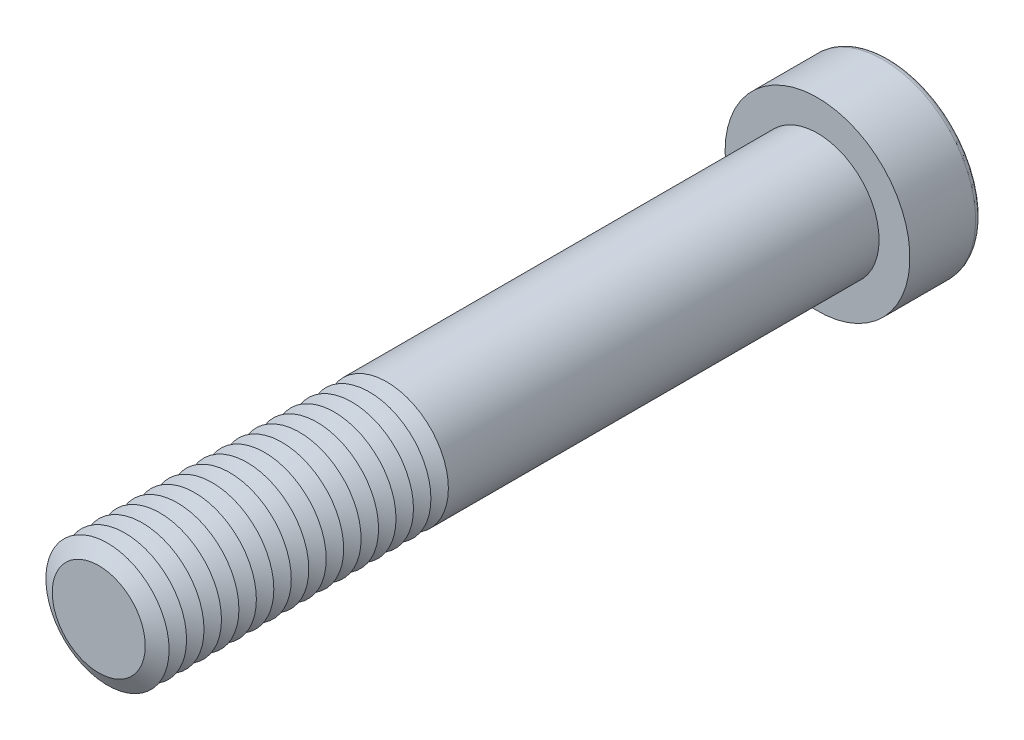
from build123d import *

# Parameters (mm, degrees)
SKETCH1_R           = 6
BOSS_EXTRUDE1_DEPTH = 70
SKETCH2_R           = 9
BOSS_EXTRUDE2_DEPTH = 7
CUT_EXTRUDE1_DEPTH  = 6
FILLET1_R           = 0.6
LPATTERN1_COUNT     = 17
LPATTERN1_PITCH     = 1.7


with BuildPart() as part:
    # Sketch1 → Boss-Extrude1 (new body)
    with BuildSketch(Plane.XY):
        Circle(SKETCH1_R)
    extrude(amount=BOSS_EXTRUDE1_DEPTH)

    # Sketch2 → Boss-Extrude2 (add)
    with BuildSketch(Plane(origin=(0, 0, 0), x_dir=(-1, 0, 0), z_dir=(0, 0, -1))):
        Circle(SKETCH2_R)
    extrude(amount=BOSS_EXTRUDE2_DEPTH)

    # Sketch3 → Cut-Extrude1 (cut)
    with BuildSketch(Plane(origin=(0, 0, -7), x_dir=(-1, 0, 0), z_dir=(0, 0, -1))):
        Polygon((-2.309401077, 4), (-4.618802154, 0), (-2.309401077, -4), (2.309401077, -4), (4.618802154, 0), (2.309401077, 4), align=None)
    extrude(amount=-CUT_EXTRUDE1_DEPTH, mode=Mode.SUBTRACT)

    # Fillet1
    fillet1_edges = [part.edges().sort_by_distance(p)[0] for p in [
        (9, 0, -7),
    ]]
    fillet(fillet1_edges, radius=FILLET1_R)

    # Cut-Extrude2 cone 1 section (on through the dimple's axis) → Cut-Extrude2 (revolve, cut)
    with BuildSketch(Plane(origin=(0, 0, -1), x_dir=(0, 1, 0), z_dir=(1, 0, 0))):
        Polygon((0, 0), (4, 0), (0, 2.309401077), align=None)
    revolve(axis=Axis((0, 0, -1), (0, 0, 1)), mode=Mode.SUBTRACT)

    # Cut-Extrude3 cone 1 section (on through the dimple's axis) → Cut-Extrude3 (revolve, cut)
    with BuildSketch(Plane(origin=(0, 0, -7), x_dir=(0, 1, 0), z_dir=(1, 0, 0))):
        Polygon((0, 0), (4.618802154, 0), (0, 1.237604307), align=None)
    revolve(axis=Axis((0, 0, -7), (0, 0, 1)), mode=Mode.SUBTRACT)

    # Sketch7 → Cut-Revolve1 (revolve, cut)
    with BuildSketch(Plane(origin=(0, 0, 0), x_dir=(0, 0, -1), z_dir=(1, 0, 0)), mode=Mode.PRIVATE) as cut_revolve1_sk:
        Polygon((-70, 4.527756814), (-69.15, 6), (-70.85, 6), align=None)
    cut_revolve1 = revolve(cut_revolve1_sk.sketch.rotate(Axis((0, 0, 70), (0, 0, -1)), 90), axis=Axis((0, 0, 70), (0, 0, -1)), mode=Mode.SUBTRACT)

    # LPattern1: Cut-Revolve1 ×17
    with Locations(*[(0, 0, -i * LPATTERN1_PITCH) for i in range(1, LPATTERN1_COUNT)]):
        add(cut_revolve1, mode=Mode.SUBTRACT)


solid = part.part
